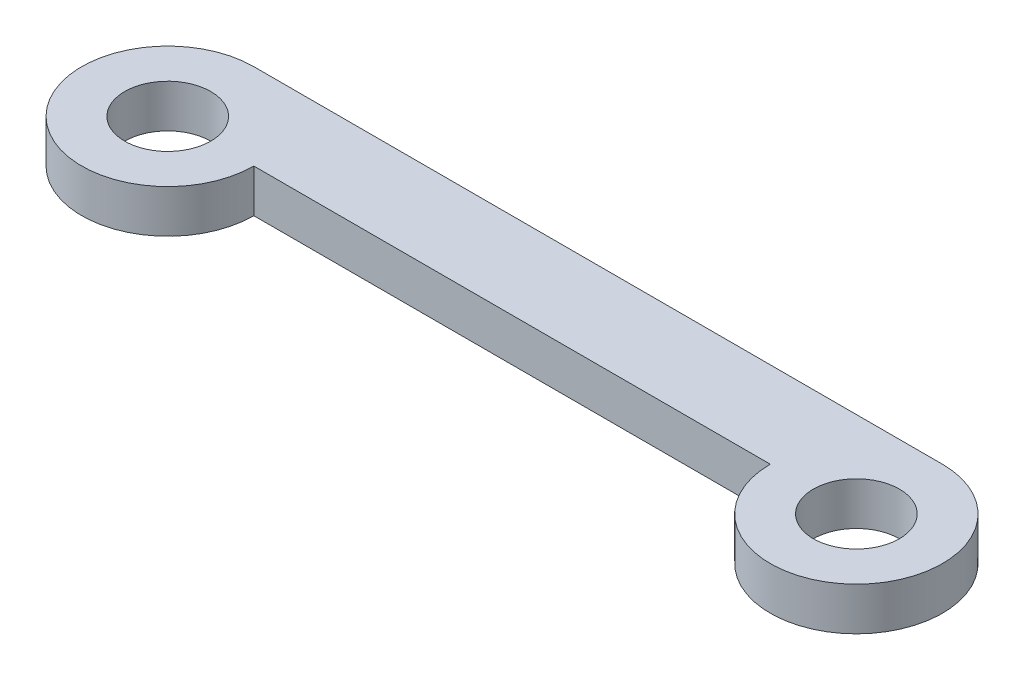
ISO-10303-21;
HEADER;
FILE_DESCRIPTION(('STEP AP214'),'2;1');
FILE_NAME('part.step','',(''),(''),'','','');
FILE_SCHEMA(('AUTOMOTIVE_DESIGN { 1 0 10303 214 1 1 1 1 }'));
ENDSEC;
DATA;
#1=APPLICATION_CONTEXT('core data for automotive mechanical design processes');
#2=APPLICATION_PROTOCOL_DEFINITION('international standard','automotive_design',2000,#1);
#3=PRODUCT_CONTEXT('',#1,'mechanical');
#4=PRODUCT('Part','Part','',(#3));
#5=PRODUCT_RELATED_PRODUCT_CATEGORY('part','',(#4));
#6=PRODUCT_DEFINITION_FORMATION('','',#4);
#7=PRODUCT_DEFINITION_CONTEXT('part definition',#1,'design');
#8=PRODUCT_DEFINITION('design','',#6,#7);
#9=PRODUCT_DEFINITION_SHAPE('','',#8);
#10=(LENGTH_UNIT() NAMED_UNIT(*) SI_UNIT(.MILLI.,.METRE.));
#11=(NAMED_UNIT(*) PLANE_ANGLE_UNIT() SI_UNIT($,.RADIAN.));
#12=(NAMED_UNIT(*) SI_UNIT($,.STERADIAN.) SOLID_ANGLE_UNIT());
#13=UNCERTAINTY_MEASURE_WITH_UNIT(LENGTH_MEASURE(1.E-05),#10,'distance_accuracy_value','');
#14=(GEOMETRIC_REPRESENTATION_CONTEXT(3) GLOBAL_UNCERTAINTY_ASSIGNED_CONTEXT((#13)) GLOBAL_UNIT_ASSIGNED_CONTEXT((#10,
#11,#12)) REPRESENTATION_CONTEXT('',''));
#15=CARTESIAN_POINT('',(0.,0.,0.));
#16=DIRECTION('',(0.,0.,1.));
#17=DIRECTION('',(1.,0.,0.));
#18=AXIS2_PLACEMENT_3D('',#15,#16,#17);
#19=CARTESIAN_POINT('',(24.5,-16.8167216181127,11.960019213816));
#20=DIRECTION('',(0.,-1.,0.));
#21=DIRECTION('',(0.,0.,-1.));
#22=AXIS2_PLACEMENT_3D('',#19,#20,#21);
#23=PLANE('',#22);
#24=CARTESIAN_POINT('',(8.5,-16.8167216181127,11.960019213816));
#25=DIRECTION('',(0.,-1.,0.));
#26=DIRECTION('',(0.,0.,-1.));
#27=AXIS2_PLACEMENT_3D('',#24,#25,#26);
#28=CIRCLE('',#27,1.);
#29=CARTESIAN_POINT('',(8.5,-16.8167216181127,10.960019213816));
#30=VERTEX_POINT('',#29);
#31=EDGE_CURVE('E75',#30,#30,#28,.F.);
#32=ORIENTED_EDGE('',*,*,#31,.T.);
#33=EDGE_LOOP('',(#32));
#34=FACE_BOUND('',#33,.T.);
#35=CARTESIAN_POINT('',(8.5,-16.8167216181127,11.960019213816));
#36=DIRECTION('',(0.,-1.,0.));
#37=DIRECTION('',(0.,0.,-1.));
#38=AXIS2_PLACEMENT_3D('',#35,#36,#37);
#39=CIRCLE('',#38,2.);
#40=CARTESIAN_POINT('',(8.5,-16.8167216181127,9.96001921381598));
#41=VERTEX_POINT('',#40);
#42=CARTESIAN_POINT('',(10.5,-16.8167216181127,11.960019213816));
#43=VERTEX_POINT('',#42);
#44=EDGE_CURVE('E20',#41,#43,#39,.F.);
#45=ORIENTED_EDGE('',*,*,#44,.F.);
#46=DIRECTION('',(1.,0.,0.));
#47=VECTOR('',#46,1.);
#48=CARTESIAN_POINT('',(24.5,-16.8167216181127,9.96001921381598));
#49=LINE('',#48,#47);
#50=CARTESIAN_POINT('',(24.5,-16.8167216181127,9.96001921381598));
#51=VERTEX_POINT('',#50);
#52=EDGE_CURVE('E60',#41,#51,#49,.T.);
#53=ORIENTED_EDGE('',*,*,#52,.T.);
#54=CARTESIAN_POINT('',(24.5,-16.8167216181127,11.960019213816));
#55=DIRECTION('',(0.,-1.,0.));
#56=DIRECTION('',(0.,0.,-1.));
#57=AXIS2_PLACEMENT_3D('',#54,#55,#56);
#58=CIRCLE('',#57,2.);
#59=CARTESIAN_POINT('',(22.5,-16.8167216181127,11.960019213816));
#60=VERTEX_POINT('',#59);
#61=EDGE_CURVE('E71',#60,#51,#58,.F.);
#62=ORIENTED_EDGE('',*,*,#61,.F.);
#63=DIRECTION('',(-1.,0.,0.));
#64=VECTOR('',#63,1.);
#65=CARTESIAN_POINT('',(10.5,-16.8167216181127,11.960019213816));
#66=LINE('',#65,#64);
#67=EDGE_CURVE('E61',#60,#43,#66,.T.);
#68=ORIENTED_EDGE('',*,*,#67,.T.);
#69=EDGE_LOOP('',(#45,#53,#62,#68));
#70=FACE_BOUND('',#69,.T.);
#71=CARTESIAN_POINT('',(24.5,-16.8167216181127,11.960019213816));
#72=DIRECTION('',(0.,-1.,0.));
#73=DIRECTION('',(0.,0.,-1.));
#74=AXIS2_PLACEMENT_3D('',#71,#72,#73);
#75=CIRCLE('',#74,1.);
#76=CARTESIAN_POINT('',(24.5,-16.8167216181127,10.960019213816));
#77=VERTEX_POINT('',#76);
#78=EDGE_CURVE('E90',#77,#77,#75,.F.);
#79=ORIENTED_EDGE('',*,*,#78,.T.);
#80=EDGE_LOOP('',(#79));
#81=FACE_BOUND('',#80,.T.);
#82=ADVANCED_FACE('F17',(#34,#70,#81),#23,.T.);
#83=CARTESIAN_POINT('',(8.5,3.18527838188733,11.960019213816));
#84=DIRECTION('',(0.,-1.,0.));
#85=DIRECTION('',(0.,0.,-1.));
#86=AXIS2_PLACEMENT_3D('',#83,#84,#85);
#87=CYLINDRICAL_SURFACE('',#86,2.);
#88=DIRECTION('',(0.,1.,0.));
#89=VECTOR('',#88,1.);
#90=CARTESIAN_POINT('',(8.5,-15.8167216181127,9.96001921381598));
#91=LINE('',#90,#89);
#92=CARTESIAN_POINT('',(8.5,-15.8167216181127,9.96001921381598));
#93=VERTEX_POINT('',#92);
#94=EDGE_CURVE('E65',#93,#41,#91,.F.);
#95=ORIENTED_EDGE('',*,*,#94,.T.);
#96=ORIENTED_EDGE('',*,*,#44,.T.);
#97=DIRECTION('',(0.,1.,0.));
#98=VECTOR('',#97,1.);
#99=CARTESIAN_POINT('',(10.5,-15.8167216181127,11.960019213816));
#100=LINE('',#99,#98);
#101=CARTESIAN_POINT('',(10.5,-15.8167216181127,11.960019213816));
#102=VERTEX_POINT('',#101);
#103=EDGE_CURVE('E79',#43,#102,#100,.T.);
#104=ORIENTED_EDGE('',*,*,#103,.T.);
#105=CARTESIAN_POINT('',(8.5,-15.8167216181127,11.960019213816));
#106=DIRECTION('',(0.,-1.,0.));
#107=DIRECTION('',(0.,0.,-1.));
#108=AXIS2_PLACEMENT_3D('',#105,#106,#107);
#109=CIRCLE('',#108,2.);
#110=EDGE_CURVE('E68',#93,#102,#109,.F.);
#111=ORIENTED_EDGE('',*,*,#110,.F.);
#112=EDGE_LOOP('',(#95,#96,#104,#111));
#113=FACE_BOUND('',#112,.T.);
#114=ADVANCED_FACE('F66',(#113),#87,.T.);
#115=CARTESIAN_POINT('',(10.5,-15.8167216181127,11.960019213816));
#116=DIRECTION('',(0.,0.,-1.));
#117=DIRECTION('',(-1.,0.,0.));
#118=AXIS2_PLACEMENT_3D('',#115,#116,#117);
#119=PLANE('',#118);
#120=ORIENTED_EDGE('',*,*,#103,.F.);
#121=ORIENTED_EDGE('',*,*,#67,.F.);
#122=DIRECTION('',(0.,-1.,0.));
#123=VECTOR('',#122,1.);
#124=CARTESIAN_POINT('',(22.5,3.18527838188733,11.960019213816));
#125=LINE('',#124,#123);
#126=CARTESIAN_POINT('',(22.5,-15.8167216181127,11.960019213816));
#127=VERTEX_POINT('',#126);
#128=EDGE_CURVE('E94',#127,#60,#125,.T.);
#129=ORIENTED_EDGE('',*,*,#128,.F.);
#130=DIRECTION('',(1.,0.,0.));
#131=VECTOR('',#130,1.);
#132=CARTESIAN_POINT('',(0.,-15.8167216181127,11.960019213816));
#133=LINE('',#132,#131);
#134=EDGE_CURVE('E88',#102,#127,#133,.T.);
#135=ORIENTED_EDGE('',*,*,#134,.F.);
#136=EDGE_LOOP('',(#120,#121,#129,#135));
#137=FACE_BOUND('',#136,.T.);
#138=ADVANCED_FACE('F104',(#137),#119,.F.);
#139=CARTESIAN_POINT('',(24.5,3.18527838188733,11.960019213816));
#140=DIRECTION('',(0.,-1.,0.));
#141=DIRECTION('',(0.,0.,-1.));
#142=AXIS2_PLACEMENT_3D('',#139,#140,#141);
#143=CYLINDRICAL_SURFACE('',#142,2.);
#144=ORIENTED_EDGE('',*,*,#128,.T.);
#145=ORIENTED_EDGE('',*,*,#61,.T.);
#146=DIRECTION('',(0.,1.,0.));
#147=VECTOR('',#146,1.);
#148=CARTESIAN_POINT('',(24.5,-15.8167216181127,9.96001921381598));
#149=LINE('',#148,#147);
#150=CARTESIAN_POINT('',(24.5,-15.8167216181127,9.96001921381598));
#151=VERTEX_POINT('',#150);
#152=EDGE_CURVE('E35',#51,#151,#149,.T.);
#153=ORIENTED_EDGE('',*,*,#152,.T.);
#154=CARTESIAN_POINT('',(24.5,-15.8167216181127,11.960019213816));
#155=DIRECTION('',(0.,-1.,0.));
#156=DIRECTION('',(0.,0.,-1.));
#157=AXIS2_PLACEMENT_3D('',#154,#155,#156);
#158=CIRCLE('',#157,2.);
#159=EDGE_CURVE('E85',#127,#151,#158,.F.);
#160=ORIENTED_EDGE('',*,*,#159,.F.);
#161=EDGE_LOOP('',(#144,#145,#153,#160));
#162=FACE_BOUND('',#161,.T.);
#163=ADVANCED_FACE('F102',(#162),#143,.T.);
#164=CARTESIAN_POINT('',(24.5,-15.8167216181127,9.96001921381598));
#165=DIRECTION('',(0.,0.,1.));
#166=DIRECTION('',(1.,0.,0.));
#167=AXIS2_PLACEMENT_3D('',#164,#165,#166);
#168=PLANE('',#167);
#169=ORIENTED_EDGE('',*,*,#152,.F.);
#170=ORIENTED_EDGE('',*,*,#52,.F.);
#171=ORIENTED_EDGE('',*,*,#94,.F.);
#172=DIRECTION('',(1.,0.,0.));
#173=VECTOR('',#172,1.);
#174=CARTESIAN_POINT('',(0.,-15.8167216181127,9.96001921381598));
#175=LINE('',#174,#173);
#176=EDGE_CURVE('E84',#151,#93,#175,.F.);
#177=ORIENTED_EDGE('',*,*,#176,.F.);
#178=EDGE_LOOP('',(#169,#170,#171,#177));
#179=FACE_BOUND('',#178,.T.);
#180=ADVANCED_FACE('F73',(#179),#168,.F.);
#181=CARTESIAN_POINT('',(8.5,3.18527838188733,11.960019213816));
#182=DIRECTION('',(0.,-1.,0.));
#183=DIRECTION('',(0.,0.,-1.));
#184=AXIS2_PLACEMENT_3D('',#181,#182,#183);
#185=CYLINDRICAL_SURFACE('',#184,1.);
#186=ORIENTED_EDGE('',*,*,#31,.F.);
#187=EDGE_LOOP('',(#186));
#188=FACE_BOUND('',#187,.T.);
#189=CARTESIAN_POINT('',(8.5,-15.8167216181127,11.960019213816));
#190=DIRECTION('',(0.,-1.,0.));
#191=DIRECTION('',(0.,0.,-1.));
#192=AXIS2_PLACEMENT_3D('',#189,#190,#191);
#193=CIRCLE('',#192,1.);
#194=CARTESIAN_POINT('',(8.5,-15.8167216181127,10.960019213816));
#195=VERTEX_POINT('',#194);
#196=EDGE_CURVE('E26',#195,#195,#193,.T.);
#197=ORIENTED_EDGE('',*,*,#196,.F.);
#198=EDGE_LOOP('',(#197));
#199=FACE_BOUND('',#198,.T.);
#200=ADVANCED_FACE('F111',(#188,#199),#185,.F.);
#201=CARTESIAN_POINT('',(24.5,3.18527838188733,11.960019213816));
#202=DIRECTION('',(0.,-1.,0.));
#203=DIRECTION('',(0.,0.,-1.));
#204=AXIS2_PLACEMENT_3D('',#201,#202,#203);
#205=CYLINDRICAL_SURFACE('',#204,1.);
#206=ORIENTED_EDGE('',*,*,#78,.F.);
#207=EDGE_LOOP('',(#206));
#208=FACE_BOUND('',#207,.T.);
#209=CARTESIAN_POINT('',(24.5,-15.8167216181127,11.960019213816));
#210=DIRECTION('',(0.,-1.,0.));
#211=DIRECTION('',(0.,0.,-1.));
#212=AXIS2_PLACEMENT_3D('',#209,#210,#211);
#213=CIRCLE('',#212,1.);
#214=CARTESIAN_POINT('',(24.5,-15.8167216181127,10.960019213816));
#215=VERTEX_POINT('',#214);
#216=EDGE_CURVE('E11',#215,#215,#213,.T.);
#217=ORIENTED_EDGE('',*,*,#216,.F.);
#218=EDGE_LOOP('',(#217));
#219=FACE_BOUND('',#218,.T.);
#220=ADVANCED_FACE('F116',(#208,#219),#205,.F.);
#221=CARTESIAN_POINT('',(0.,-15.8167216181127,0.));
#222=DIRECTION('',(0.,1.,0.));
#223=DIRECTION('',(0.,0.,1.));
#224=AXIS2_PLACEMENT_3D('',#221,#222,#223);
#225=PLANE('',#224);
#226=ORIENTED_EDGE('',*,*,#216,.T.);
#227=EDGE_LOOP('',(#226));
#228=FACE_BOUND('',#227,.T.);
#229=ORIENTED_EDGE('',*,*,#196,.T.);
#230=EDGE_LOOP('',(#229));
#231=FACE_BOUND('',#230,.T.);
#232=ORIENTED_EDGE('',*,*,#159,.T.);
#233=ORIENTED_EDGE('',*,*,#176,.T.);
#234=ORIENTED_EDGE('',*,*,#110,.T.);
#235=ORIENTED_EDGE('',*,*,#134,.T.);
#236=EDGE_LOOP('',(#232,#233,#234,#235));
#237=FACE_BOUND('',#236,.T.);
#238=ADVANCED_FACE('F100',(#228,#231,#237),#225,.T.);
#239=CLOSED_SHELL('',(#82,#114,#138,#163,#180,#200,#220,#238));
#240=MANIFOLD_SOLID_BREP('B1',#239);
#241=ADVANCED_BREP_SHAPE_REPRESENTATION('',(#18,#240),#14);
#242=SHAPE_DEFINITION_REPRESENTATION(#9,#241);
ENDSEC;
END-ISO-10303-21;
